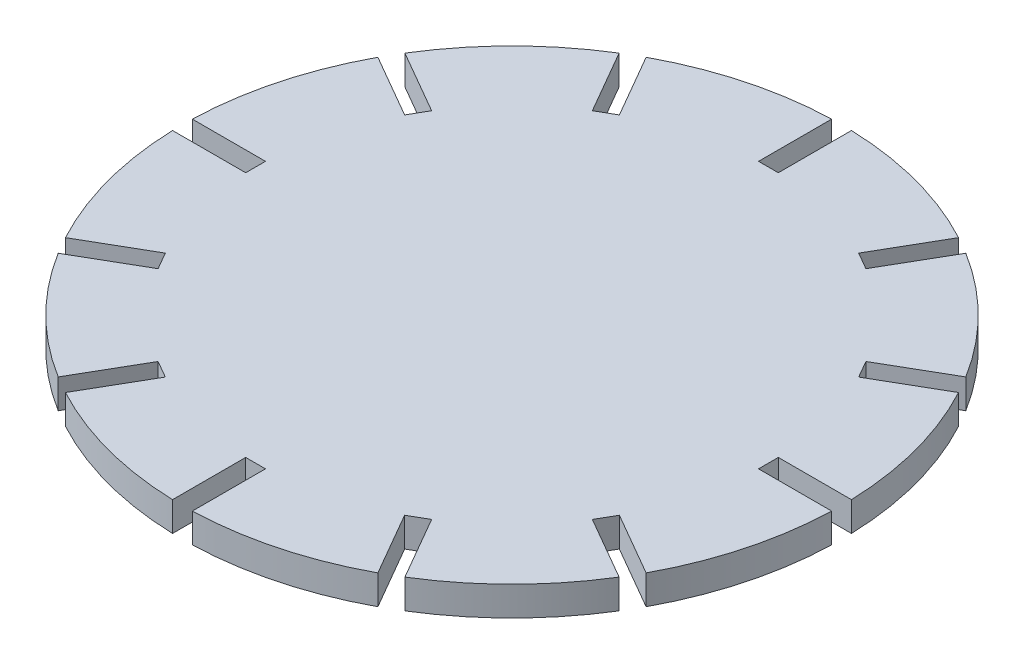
from build123d import *

# Parameters (mm, degrees)
BOSS_EXTRUDE1_DEPTH = 4


with BuildPart() as part:
    # Sketch1 → Boss-Extrude1 (new body)
    with BuildSketch(Plane(origin=(0, 0, 0), x_dir=(1, 0, 0), z_dir=(0, 1, 0))):
        with BuildLine():
            Line((30.985668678, -16.330738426), (39.628602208, -21.320738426))
            ThreePointArc((39.628602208, -21.320738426), (43.466662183, -11.64685703), (44.979745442, -1.35))
            Line((44.979745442, -1.35), (34.999745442, -1.35))
            Line((34.999745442, -1.35), (34.999745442, 1.35))
            Line((34.999745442, 1.35), (44.979745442, 1.35))
            ThreePointArc((44.979745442, 1.35), (43.466662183, 11.64685703), (39.628602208, 21.320738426))
            Line((39.628602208, 21.320738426), (30.985668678, 16.330738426))
            Line((30.985668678, 16.330738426), (29.635668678, 18.669007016))
            Line((29.635668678, 18.669007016), (38.278602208, 23.659007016))
            ThreePointArc((38.278602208, 23.659007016), (31.819805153, 31.819805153), (23.659007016, 38.278602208))
            Line((23.659007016, 38.278602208), (18.669007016, 29.635668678))
            Line((18.669007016, 29.635668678), (16.330738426, 30.985668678))
            Line((16.330738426, 30.985668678), (21.320738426, 39.628602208))
            ThreePointArc((21.320738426, 39.628602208), (11.64685703, 43.466662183), (1.35, 44.979745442))
            Line((1.35, 44.979745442), (1.35, 34.999745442))
            Line((1.35, 34.999745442), (-1.35, 34.999745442))
            Line((-1.35, 34.999745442), (-1.35, 44.979745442))
            ThreePointArc((-1.35, 44.979745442), (-11.64685703, 43.466662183), (-21.320738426, 39.628602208))
            Line((-21.320738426, 39.628602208), (-16.330738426, 30.985668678))
            Line((-16.330738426, 30.985668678), (-18.669007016, 29.635668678))
            Line((-18.669007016, 29.635668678), (-23.659007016, 38.278602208))
            ThreePointArc((-23.659007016, 38.278602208), (-31.819805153, 31.819805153), (-38.278602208, 23.659007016))
            Line((-38.278602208, 23.659007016), (-29.635668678, 18.669007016))
            Line((-29.635668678, 18.669007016), (-30.985668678, 16.330738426))
            Line((-30.985668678, 16.330738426), (-39.628602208, 21.320738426))
            ThreePointArc((-39.628602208, 21.320738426), (-43.466662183, 11.64685703), (-44.979745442, 1.35))
            Line((-44.979745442, 1.35), (-34.999745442, 1.35))
            Line((-34.999745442, 1.35), (-34.999745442, -1.35))
            Line((-34.999745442, -1.35), (-44.979745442, -1.35))
            ThreePointArc((-44.979745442, -1.35), (-43.466662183, -11.64685703), (-39.628602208, -21.320738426))
            Line((-39.628602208, -21.320738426), (-30.985668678, -16.330738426))
            Line((-30.985668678, -16.330738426), (-29.635668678, -18.669007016))
            Line((-29.635668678, -18.669007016), (-38.278602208, -23.659007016))
            ThreePointArc((-38.278602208, -23.659007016), (-31.819805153, -31.819805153), (-23.659007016, -38.278602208))
            Line((-23.659007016, -38.278602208), (-18.669007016, -29.635668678))
            Line((-18.669007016, -29.635668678), (-16.330738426, -30.985668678))
            Line((-16.330738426, -30.985668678), (-21.320738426, -39.628602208))
            ThreePointArc((-21.320738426, -39.628602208), (-11.64685703, -43.466662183), (-1.35, -44.979745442))
            Line((-1.35, -44.979745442), (-1.35, -34.999745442))
            Line((-1.35, -34.999745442), (1.35, -34.999745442))
            Line((1.35, -34.999745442), (1.35, -44.979745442))
            ThreePointArc((1.35, -44.979745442), (11.64685703, -43.466662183), (21.320738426, -39.628602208))
            Line((21.320738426, -39.628602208), (16.330738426, -30.985668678))
            Line((16.330738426, -30.985668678), (18.669007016, -29.635668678))
            Line((18.669007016, -29.635668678), (23.659007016, -38.278602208))
            ThreePointArc((23.659007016, -38.278602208), (31.819805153, -31.819805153), (38.278602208, -23.659007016))
            Line((38.278602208, -23.659007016), (29.635668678, -18.669007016))
            Line((29.635668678, -18.669007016), (30.985668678, -16.330738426))
        make_face()
    extrude(amount=BOSS_EXTRUDE1_DEPTH)


solid = part.part
